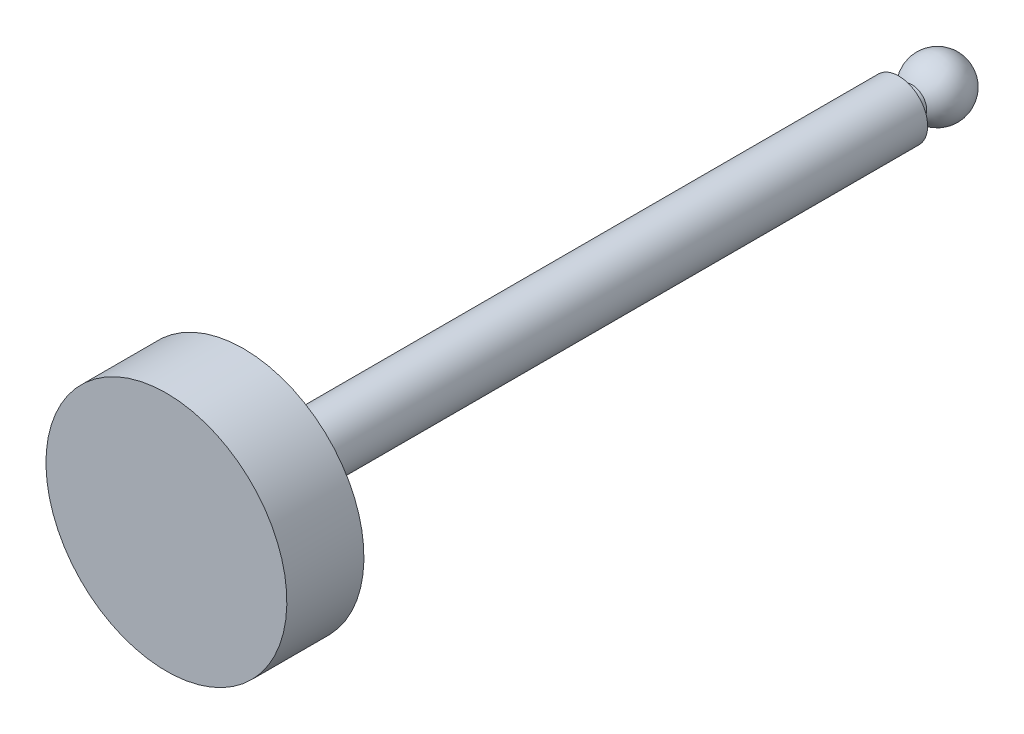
ISO-10303-21;
HEADER;
FILE_DESCRIPTION(('STEP AP214'),'2;1');
FILE_NAME('part.step','',(''),(''),'','','');
FILE_SCHEMA(('AUTOMOTIVE_DESIGN { 1 0 10303 214 1 1 1 1 }'));
ENDSEC;
DATA;
#1=APPLICATION_CONTEXT('core data for automotive mechanical design processes');
#2=APPLICATION_PROTOCOL_DEFINITION('international standard','automotive_design',2000,#1);
#3=PRODUCT_CONTEXT('',#1,'mechanical');
#4=PRODUCT('Part','Part','',(#3));
#5=PRODUCT_RELATED_PRODUCT_CATEGORY('part','',(#4));
#6=PRODUCT_DEFINITION_FORMATION('','',#4);
#7=PRODUCT_DEFINITION_CONTEXT('part definition',#1,'design');
#8=PRODUCT_DEFINITION('design','',#6,#7);
#9=PRODUCT_DEFINITION_SHAPE('','',#8);
#10=(LENGTH_UNIT() NAMED_UNIT(*) SI_UNIT(.MILLI.,.METRE.));
#11=(NAMED_UNIT(*) PLANE_ANGLE_UNIT() SI_UNIT($,.RADIAN.));
#12=(NAMED_UNIT(*) SI_UNIT($,.STERADIAN.) SOLID_ANGLE_UNIT());
#13=UNCERTAINTY_MEASURE_WITH_UNIT(LENGTH_MEASURE(1.E-05),#10,'distance_accuracy_value','');
#14=(GEOMETRIC_REPRESENTATION_CONTEXT(3) GLOBAL_UNCERTAINTY_ASSIGNED_CONTEXT((#13)) GLOBAL_UNIT_ASSIGNED_CONTEXT((#10,
#11,#12)) REPRESENTATION_CONTEXT('',''));
#15=CARTESIAN_POINT('',(0.,0.,0.));
#16=DIRECTION('',(0.,0.,1.));
#17=DIRECTION('',(1.,0.,0.));
#18=AXIS2_PLACEMENT_3D('',#15,#16,#17);
#19=CARTESIAN_POINT('',(0.,-12.5,83.));
#20=DIRECTION('',(0.,0.,-1.));
#21=DIRECTION('',(0.,-1.,0.));
#22=AXIS2_PLACEMENT_3D('',#19,#20,#21);
#23=PLANE('',#22);
#24=CARTESIAN_POINT('',(0.,0.,83.));
#25=DIRECTION('',(0.,0.,1.));
#26=DIRECTION('',(0.,1.,0.));
#27=AXIS2_PLACEMENT_3D('',#24,#25,#26);
#28=CIRCLE('',#27,12.5);
#29=CARTESIAN_POINT('',(0.,12.5,83.));
#30=VERTEX_POINT('',#29);
#31=EDGE_CURVE('E34',#30,#30,#28,.T.);
#32=ORIENTED_EDGE('',*,*,#31,.T.);
#33=EDGE_LOOP('',(#32));
#34=FACE_BOUND('',#33,.T.);
#35=ADVANCED_FACE('F12',(#34),#23,.F.);
#36=CARTESIAN_POINT('',(0.,0.,3.));
#37=DIRECTION('',(0.,-1.,0.));
#38=DIRECTION('',(-1.,0.,0.));
#39=AXIS2_PLACEMENT_3D('',#36,#37,#38);
#40=SPHERICAL_SURFACE('',#39,3.);
#41=CARTESIAN_POINT('',(0.,0.,3.));
#42=DIRECTION('',(0.,0.,1.));
#43=DIRECTION('',(0.,1.,0.));
#44=AXIS2_PLACEMENT_3D('',#41,#42,#43);
#45=SPHERICAL_SURFACE('',#44,3.);
#46=CARTESIAN_POINT('',(0.,0.,5.59807621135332));
#47=DIRECTION('',(0.,0.,1.));
#48=DIRECTION('',(0.,1.,0.));
#49=AXIS2_PLACEMENT_3D('',#46,#47,#48);
#50=CIRCLE('',#49,1.5);
#51=CARTESIAN_POINT('',(0.,1.5,5.59807621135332));
#52=VERTEX_POINT('',#51);
#53=EDGE_CURVE('E8',#52,#52,#50,.T.);
#54=ORIENTED_EDGE('',*,*,#53,.F.);
#55=EDGE_LOOP('',(#54));
#56=FACE_BOUND('',#55,.T.);
#57=ADVANCED_FACE('F63',(#56),#45,.T.);
#58=CARTESIAN_POINT('',(0.,0.,83.));
#59=DIRECTION('',(0.,0.,1.));
#60=DIRECTION('',(0.,1.,0.));
#61=AXIS2_PLACEMENT_3D('',#58,#59,#60);
#62=CYLINDRICAL_SURFACE('',#61,1.5);
#63=ORIENTED_EDGE('',*,*,#53,.T.);
#64=EDGE_LOOP('',(#63));
#65=FACE_BOUND('',#64,.T.);
#66=CARTESIAN_POINT('',(0.,0.,7.));
#67=DIRECTION('',(0.,0.,1.));
#68=DIRECTION('',(0.,1.,0.));
#69=AXIS2_PLACEMENT_3D('',#66,#67,#68);
#70=CIRCLE('',#69,1.5);
#71=CARTESIAN_POINT('',(0.,1.5,7.));
#72=VERTEX_POINT('',#71);
#73=EDGE_CURVE('E18',#72,#72,#70,.T.);
#74=ORIENTED_EDGE('',*,*,#73,.F.);
#75=EDGE_LOOP('',(#74));
#76=FACE_BOUND('',#75,.T.);
#77=ADVANCED_FACE('F60',(#65,#76),#62,.T.);
#78=CARTESIAN_POINT('',(0.,-3.,7.));
#79=DIRECTION('',(0.,0.,-1.));
#80=DIRECTION('',(0.,-1.,0.));
#81=AXIS2_PLACEMENT_3D('',#78,#79,#80);
#82=PLANE('',#81);
#83=ORIENTED_EDGE('',*,*,#73,.T.);
#84=EDGE_LOOP('',(#83));
#85=FACE_BOUND('',#84,.T.);
#86=CARTESIAN_POINT('',(0.,0.,7.));
#87=DIRECTION('',(0.,0.,1.));
#88=DIRECTION('',(0.,1.,0.));
#89=AXIS2_PLACEMENT_3D('',#86,#87,#88);
#90=CIRCLE('',#89,3.);
#91=CARTESIAN_POINT('',(0.,3.,7.));
#92=VERTEX_POINT('',#91);
#93=EDGE_CURVE('E22',#92,#92,#90,.T.);
#94=ORIENTED_EDGE('',*,*,#93,.F.);
#95=EDGE_LOOP('',(#94));
#96=FACE_BOUND('',#95,.T.);
#97=ADVANCED_FACE('F53',(#85,#96),#82,.T.);
#98=CARTESIAN_POINT('',(0.,0.,83.));
#99=DIRECTION('',(0.,0.,1.));
#100=DIRECTION('',(0.,1.,0.));
#101=AXIS2_PLACEMENT_3D('',#98,#99,#100);
#102=CYLINDRICAL_SURFACE('',#101,3.);
#103=ORIENTED_EDGE('',*,*,#93,.T.);
#104=EDGE_LOOP('',(#103));
#105=FACE_BOUND('',#104,.T.);
#106=CARTESIAN_POINT('',(0.,0.,75.));
#107=DIRECTION('',(0.,0.,1.));
#108=DIRECTION('',(0.,1.,0.));
#109=AXIS2_PLACEMENT_3D('',#106,#107,#108);
#110=CIRCLE('',#109,3.);
#111=CARTESIAN_POINT('',(0.,3.,75.));
#112=VERTEX_POINT('',#111);
#113=EDGE_CURVE('E26',#112,#112,#110,.T.);
#114=ORIENTED_EDGE('',*,*,#113,.F.);
#115=EDGE_LOOP('',(#114));
#116=FACE_BOUND('',#115,.T.);
#117=ADVANCED_FACE('F48',(#105,#116),#102,.T.);
#118=CARTESIAN_POINT('',(0.,-3.,75.));
#119=DIRECTION('',(0.,0.,1.));
#120=DIRECTION('',(0.,1.,0.));
#121=AXIS2_PLACEMENT_3D('',#118,#119,#120);
#122=PLANE('',#121);
#123=CARTESIAN_POINT('',(0.,0.,75.));
#124=DIRECTION('',(0.,0.,1.));
#125=DIRECTION('',(0.,1.,0.));
#126=AXIS2_PLACEMENT_3D('',#123,#124,#125);
#127=CIRCLE('',#126,12.5);
#128=CARTESIAN_POINT('',(0.,12.5,75.));
#129=VERTEX_POINT('',#128);
#130=EDGE_CURVE('E31',#129,#129,#127,.T.);
#131=ORIENTED_EDGE('',*,*,#130,.F.);
#132=EDGE_LOOP('',(#131));
#133=FACE_BOUND('',#132,.T.);
#134=ORIENTED_EDGE('',*,*,#113,.T.);
#135=EDGE_LOOP('',(#134));
#136=FACE_BOUND('',#135,.T.);
#137=ADVANCED_FACE('F42',(#133,#136),#122,.F.);
#138=CARTESIAN_POINT('',(0.,0.,83.));
#139=DIRECTION('',(0.,0.,1.));
#140=DIRECTION('',(0.,1.,0.));
#141=AXIS2_PLACEMENT_3D('',#138,#139,#140);
#142=CYLINDRICAL_SURFACE('',#141,12.5);
#143=ORIENTED_EDGE('',*,*,#31,.F.);
#144=EDGE_LOOP('',(#143));
#145=FACE_BOUND('',#144,.T.);
#146=ORIENTED_EDGE('',*,*,#130,.T.);
#147=EDGE_LOOP('',(#146));
#148=FACE_BOUND('',#147,.T.);
#149=ADVANCED_FACE('F39',(#145,#148),#142,.T.);
#150=CLOSED_SHELL('',(#35,#57,#77,#97,#117,#137,#149));
#151=MANIFOLD_SOLID_BREP('B1',#150);
#152=ADVANCED_BREP_SHAPE_REPRESENTATION('',(#18,#151),#14);
#153=SHAPE_DEFINITION_REPRESENTATION(#9,#152);
ENDSEC;
END-ISO-10303-21;
